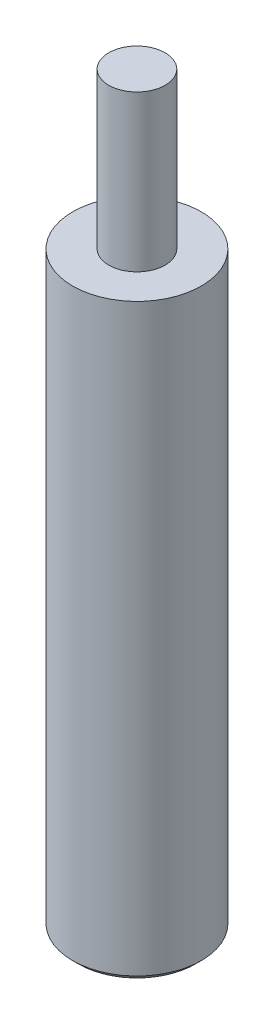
from build123d import *

# Parameters (mm, degrees)
SKETCH1_R           = 5.5372
BOSS_EXTRUDE1_DEPTH = 50.8
SKETCH2_R           = 2.4257
BOSS_EXTRUDE2_DEPTH = 13.4112
CHAMFER1_SIZE       = 0.508


with BuildPart() as part:
    # Sketch1 → Boss-Extrude1 (new body)
    with BuildSketch(Plane(origin=(0, 0, 0), x_dir=(1, 0, 0), z_dir=(0, 1, 0))):
        with Locations(Location((0, 0, 0), (0, 0, 270))):
            Circle(SKETCH1_R)
    extrude(amount=BOSS_EXTRUDE1_DEPTH)

    # Sketch2 → Boss-Extrude2 (add)
    with BuildSketch(Plane(origin=(0, 50.8, 0), x_dir=(1, 0, 0), z_dir=(0, 1, 0))):
        with Locations(Location((0, 0, 0), (0, 0, 270))):
            Circle(SKETCH2_R)
    extrude(amount=BOSS_EXTRUDE2_DEPTH)

    # Chamfer1
    chamfer1_edges = [part.edges().sort_by_distance(p)[0] for p in [
        (0, 0, -5.5372),
    ]]
    chamfer(chamfer1_edges, length=CHAMFER1_SIZE)


solid = part.part
